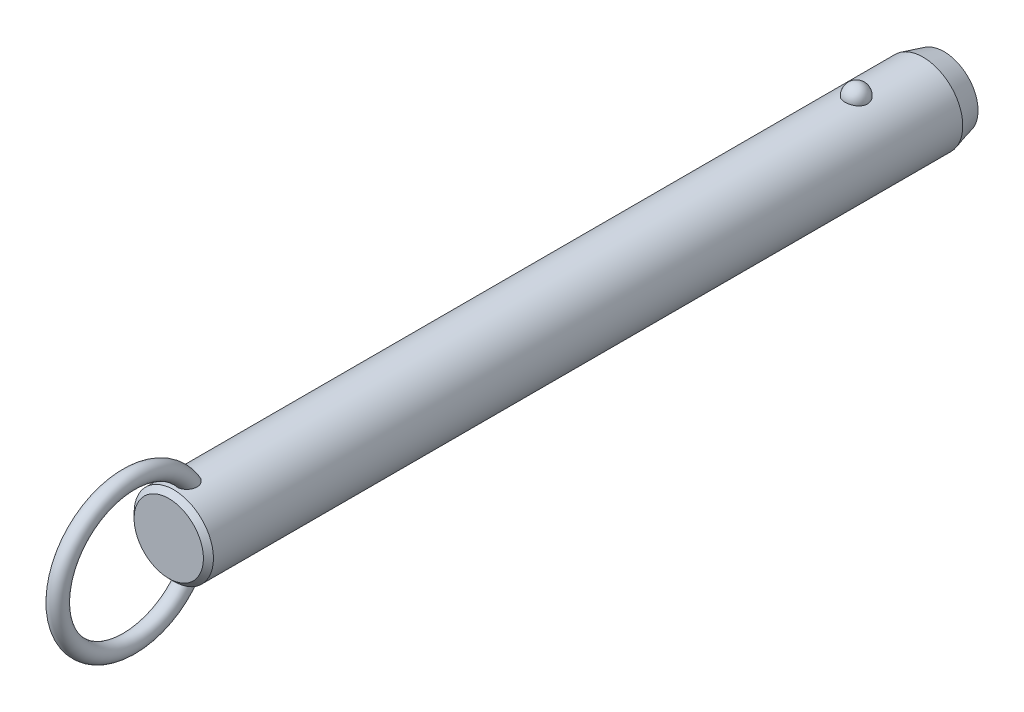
ISO-10303-21;
HEADER;
FILE_DESCRIPTION(('STEP AP214'),'2;1');
FILE_NAME('part.step','',(''),(''),'','','');
FILE_SCHEMA(('AUTOMOTIVE_DESIGN { 1 0 10303 214 1 1 1 1 }'));
ENDSEC;
DATA;
#1=APPLICATION_CONTEXT('core data for automotive mechanical design processes');
#2=APPLICATION_PROTOCOL_DEFINITION('international standard','automotive_design',2000,#1);
#3=PRODUCT_CONTEXT('',#1,'mechanical');
#4=PRODUCT('Part','Part','',(#3));
#5=PRODUCT_RELATED_PRODUCT_CATEGORY('part','',(#4));
#6=PRODUCT_DEFINITION_FORMATION('','',#4);
#7=PRODUCT_DEFINITION_CONTEXT('part definition',#1,'design');
#8=PRODUCT_DEFINITION('design','',#6,#7);
#9=PRODUCT_DEFINITION_SHAPE('','',#8);
#10=(LENGTH_UNIT() NAMED_UNIT(*) SI_UNIT(.MILLI.,.METRE.));
#11=(NAMED_UNIT(*) PLANE_ANGLE_UNIT() SI_UNIT($,.RADIAN.));
#12=(NAMED_UNIT(*) SI_UNIT($,.STERADIAN.) SOLID_ANGLE_UNIT());
#13=UNCERTAINTY_MEASURE_WITH_UNIT(LENGTH_MEASURE(1.E-05),#10,'distance_accuracy_value','');
#14=(GEOMETRIC_REPRESENTATION_CONTEXT(3) GLOBAL_UNCERTAINTY_ASSIGNED_CONTEXT((#13)) GLOBAL_UNIT_ASSIGNED_CONTEXT((#10,
#11,#12)) REPRESENTATION_CONTEXT('',''));
#15=CARTESIAN_POINT('',(0.,0.,0.));
#16=DIRECTION('',(0.,0.,1.));
#17=DIRECTION('',(1.,0.,0.));
#18=AXIS2_PLACEMENT_3D('',#15,#16,#17);
#19=CARTESIAN_POINT('',(0.,0.,152.4));
#20=DIRECTION('',(0.,0.,-1.));
#21=DIRECTION('',(-1.,0.,0.));
#22=AXIS2_PLACEMENT_3D('',#19,#20,#21);
#23=CYLINDRICAL_SURFACE('',#22,9.5);
#24=CARTESIAN_POINT('',(2.67259918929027,9.11631578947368,-2.7));
#25=CARTESIAN_POINT('',(2.6725968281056,9.11631786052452,-2.5490985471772));
#26=CARTESIAN_POINT('',(2.66030567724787,9.11994722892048,-2.39816735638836));
#27=CARTESIAN_POINT('',(2.6114347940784,9.13405924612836,-2.10058568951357));
#28=CARTESIAN_POINT('',(2.57484658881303,9.14454428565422,-1.9539367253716));
#29=CARTESIAN_POINT('',(2.47830875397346,9.17117631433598,-1.6691606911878));
#30=CARTESIAN_POINT('',(2.41836936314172,9.18732082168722,-1.53102991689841));
#31=CARTESIAN_POINT('',(2.27661331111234,9.22346780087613,-1.26705393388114));
#32=CARTESIAN_POINT('',(2.19479699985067,9.24347021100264,-1.14120852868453));
#33=CARTESIAN_POINT('',(2.01085282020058,9.28522401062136,-0.904632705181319));
#34=CARTESIAN_POINT('',(1.90862396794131,9.30698376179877,-0.793982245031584));
#35=CARTESIAN_POINT('',(1.6867437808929,9.34973971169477,-0.591607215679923));
#36=CARTESIAN_POINT('',(1.56709244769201,9.37073591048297,-0.4998826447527));
#37=CARTESIAN_POINT('',(1.31393976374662,9.40956370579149,-0.33816762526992));
#38=CARTESIAN_POINT('',(1.18048026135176,9.42740444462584,-0.268113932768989));
#39=CARTESIAN_POINT('',(0.903154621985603,9.45799906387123,-0.151390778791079));
#40=CARTESIAN_POINT('',(0.759289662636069,9.47075351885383,-0.104718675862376));
#41=CARTESIAN_POINT('',(0.468074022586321,9.48956256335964,-0.0367633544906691));
#42=CARTESIAN_POINT('',(0.320836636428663,9.49573643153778,-0.0150275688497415));
#43=CARTESIAN_POINT('',(0.0246714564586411,9.50112183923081,0.0039619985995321));
#44=CARTESIAN_POINT('',(-0.124256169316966,9.50033406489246,0.00121819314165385));
#45=CARTESIAN_POINT('',(-0.417264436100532,9.4919475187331,-0.0284441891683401));
#46=CARTESIAN_POINT('',(-0.56138413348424,9.48444885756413,-0.0550074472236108));
#47=CARTESIAN_POINT('',(-0.842986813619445,9.46357853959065,-0.131064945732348));
#48=CARTESIAN_POINT('',(-0.980469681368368,9.450206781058,-0.18055958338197));
#49=CARTESIAN_POINT('',(-1.24585005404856,9.41890822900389,-0.301476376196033));
#50=CARTESIAN_POINT('',(-1.37368611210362,9.40095498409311,-0.373026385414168));
#51=CARTESIAN_POINT('',(-1.61552738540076,9.36242964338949,-0.53602540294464));
#52=CARTESIAN_POINT('',(-1.72953116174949,9.34185727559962,-0.62747647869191));
#53=CARTESIAN_POINT('',(-1.9429225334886,9.29984568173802,-0.829844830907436));
#54=CARTESIAN_POINT('',(-2.04198021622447,9.27839736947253,-0.941108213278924));
#55=CARTESIAN_POINT('',(-2.2202646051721,9.23735994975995,-1.17883414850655));
#56=CARTESIAN_POINT('',(-2.29948985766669,9.21777097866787,-1.30529781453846));
#57=CARTESIAN_POINT('',(-2.43697287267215,9.18238994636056,-1.57158566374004));
#58=CARTESIAN_POINT('',(-2.49497068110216,9.16664569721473,-1.71155057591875));
#59=CARTESIAN_POINT('',(-2.5872073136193,9.14104303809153,-1.99961197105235));
#60=CARTESIAN_POINT('',(-2.62144683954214,9.13118445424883,-2.14770821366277));
#61=CARTESIAN_POINT('',(-2.66521466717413,9.11850622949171,-2.44715424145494));
#62=CARTESIAN_POINT('',(-2.67484831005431,9.11565658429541,-2.59848735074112));
#63=CARTESIAN_POINT('',(-2.66946735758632,9.11723375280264,-2.90067317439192));
#64=CARTESIAN_POINT('',(-2.65445345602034,9.12166036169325,-3.05152590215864));
#65=CARTESIAN_POINT('',(-2.60029711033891,9.13724422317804,-3.34766110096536));
#66=CARTESIAN_POINT('',(-2.56127978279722,9.14836656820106,-3.49296833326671));
#67=CARTESIAN_POINT('',(-2.46018844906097,9.17606676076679,-3.77477535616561));
#68=CARTESIAN_POINT('',(-2.39811349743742,9.1926448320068,-3.91127478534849));
#69=CARTESIAN_POINT('',(-2.25202303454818,9.22952198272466,-4.17244273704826));
#70=CARTESIAN_POINT('',(-2.16788714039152,9.24984129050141,-4.29704106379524));
#71=CARTESIAN_POINT('',(-1.97994083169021,9.29188255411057,-4.53013066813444));
#72=CARTESIAN_POINT('',(-1.87612963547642,9.31360456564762,-4.63862130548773));
#73=CARTESIAN_POINT('',(-1.65105429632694,9.35612959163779,-4.83690299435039));
#74=CARTESIAN_POINT('',(-1.52972405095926,9.37692871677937,-4.92661991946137));
#75=CARTESIAN_POINT('',(-1.27318250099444,9.41518970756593,-5.08429106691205));
#76=CARTESIAN_POINT('',(-1.13797219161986,9.432651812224,-5.15224684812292));
#77=CARTESIAN_POINT('',(-0.859280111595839,9.46208255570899,-5.26371827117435));
#78=CARTESIAN_POINT('',(-0.715925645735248,9.47411833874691,-5.30753421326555));
#79=CARTESIAN_POINT('',(-0.423550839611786,9.4916822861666,-5.37076321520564));
#80=CARTESIAN_POINT('',(-0.274531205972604,9.49721125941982,-5.39017930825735));
#81=CARTESIAN_POINT('',(0.0218446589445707,9.50110860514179,-5.40390587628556));
#82=CARTESIAN_POINT('',(0.169177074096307,9.49961381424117,-5.39869609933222));
#83=CARTESIAN_POINT('',(0.460808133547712,9.48993906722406,-5.3644195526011));
#84=CARTESIAN_POINT('',(0.605106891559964,9.48175936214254,-5.33535367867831));
#85=CARTESIAN_POINT('',(0.886027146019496,9.4596376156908,-5.2543558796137));
#86=CARTESIAN_POINT('',(1.02267710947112,9.44571881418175,-5.20251612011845));
#87=CARTESIAN_POINT('',(1.28523827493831,9.41358993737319,-5.07741549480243));
#88=CARTESIAN_POINT('',(1.41114877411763,9.39537958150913,-5.0041532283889));
#89=CARTESIAN_POINT('',(1.65085227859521,9.3562644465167,-4.83684599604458));
#90=CARTESIAN_POINT('',(1.76442346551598,9.33532178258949,-4.74249218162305));
#91=CARTESIAN_POINT('',(1.97425672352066,9.29321198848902,-4.53620389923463));
#92=CARTESIAN_POINT('',(2.07051582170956,9.27204482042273,-4.42426641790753));
#93=CARTESIAN_POINT('',(2.24490086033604,9.23139221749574,-4.18363183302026));
#94=CARTESIAN_POINT('',(2.32267019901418,9.21194380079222,-4.05466990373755));
#95=CARTESIAN_POINT('',(2.45584092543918,9.1773419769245,-3.78517836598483));
#96=CARTESIAN_POINT('',(2.5112497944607,9.16218713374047,-3.64465264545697));
#97=CARTESIAN_POINT('',(2.59380876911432,9.13913522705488,-3.37104301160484));
#98=CARTESIAN_POINT('',(2.62330266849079,9.13064624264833,-3.23871053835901));
#99=CARTESIAN_POINT('',(2.66269870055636,9.11923566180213,-2.97092664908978));
#100=CARTESIAN_POINT('',(2.67260130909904,9.11631393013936,-2.8354753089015));
#101=CARTESIAN_POINT('',(2.67259918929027,9.11631578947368,-2.7));
#102=B_SPLINE_CURVE_WITH_KNOTS('',3,(#24,#25,#26,#27,#28,#29,#30,#31,#32,#33,#34,#35,#36,#37,
#38,#39,#40,#41,#42,#43,#44,#45,#46,#47,#48,#49,#50,#51,#52,#53,#54,#55,#56,#57,#58,#59,#60,#61,
#62,#63,#64,#65,#66,#67,#68,#69,#70,#71,#72,#73,#74,#75,#76,#77,#78,#79,#80,#81,#82,#83,#84,#85,
#86,#87,#88,#89,#90,#91,#92,#93,#94,#95,#96,#97,#98,#99,#100,#101),.UNSPECIFIED.,.T.,.F.,(4,2,2,
2,2,2,2,2,2,2,2,2,2,2,2,2,2,2,2,2,2,2,2,2,2,2,2,2,2,2,2,2,2,2,2,2,2,2,4),(0.,0.452217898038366,
0.904593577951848,1.35677112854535,1.80894144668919,2.26340676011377,2.71787203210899,
3.17099820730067,3.62407318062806,4.06878835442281,4.51345969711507,4.95160616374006,
5.38976021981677,5.83050358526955,6.27129275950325,6.72071308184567,7.17016633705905,
7.62495278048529,8.07972578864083,8.53254856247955,8.98535859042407,9.43582813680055,
9.88631615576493,10.3393155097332,10.7923328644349,11.2471065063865,11.7018475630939,
12.150795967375,12.599688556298,13.0398725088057,13.4800399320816,13.9184421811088,
14.3568730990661,14.802202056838,15.2476074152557,15.7010097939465,16.1542603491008,
16.5602594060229,16.9662486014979),.UNSPECIFIED.);
#103=CARTESIAN_POINT('',(2.67259918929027,9.11631578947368,-2.7));
#104=VERTEX_POINT('',#103);
#105=EDGE_CURVE('E41',#104,#104,#102,.T.);
#106=ORIENTED_EDGE('',*,*,#105,.T.);
#107=EDGE_LOOP('',(#106));
#108=FACE_BOUND('',#107,.T.);
#109=CARTESIAN_POINT('',(0.,0.,160.72));
#110=DIRECTION('',(0.,0.,1.));
#111=DIRECTION('',(1.,0.,0.));
#112=AXIS2_PLACEMENT_3D('',#109,#110,#111);
#113=CIRCLE('',#112,9.5);
#114=CARTESIAN_POINT('',(9.5,0.,160.72));
#115=VERTEX_POINT('',#114);
#116=EDGE_CURVE('E10',#115,#115,#113,.F.);
#117=ORIENTED_EDGE('',*,*,#116,.T.);
#118=EDGE_LOOP('',(#117));
#119=FACE_BOUND('',#118,.T.);
#120=CARTESIAN_POINT('',(-0.697062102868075,-9.47439269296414,155.067808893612));
#121=CARTESIAN_POINT('',(-0.799579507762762,-9.46685146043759,155.107482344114));
#122=CARTESIAN_POINT('',(-0.898575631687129,-9.45788043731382,155.1559309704));
#123=CARTESIAN_POINT('',(-1.08670047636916,-9.43811593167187,155.268868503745));
#124=CARTESIAN_POINT('',(-1.17583204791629,-9.42732297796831,155.333352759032));
#125=CARTESIAN_POINT('',(-1.34179806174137,-9.40513672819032,155.476209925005));
#126=CARTESIAN_POINT('',(-1.41865133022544,-9.39374438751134,155.554561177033));
#127=CARTESIAN_POINT('',(-1.55860047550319,-9.37154196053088,155.722752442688));
#128=CARTESIAN_POINT('',(-1.62169476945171,-9.3607319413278,155.81259377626));
#129=CARTESIAN_POINT('',(-1.73527695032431,-9.34035749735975,156.004500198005));
#130=CARTESIAN_POINT('',(-1.78522266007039,-9.33085270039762,156.106891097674));
#131=CARTESIAN_POINT('',(-1.86924997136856,-9.3143834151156,156.318148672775));
#132=CARTESIAN_POINT('',(-1.90332570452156,-9.30741986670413,156.427017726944));
#133=CARTESIAN_POINT('',(-1.95893603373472,-9.29588482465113,156.660473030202));
#134=CARTESIAN_POINT('',(-1.97872420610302,-9.29165182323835,156.785489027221));
#135=CARTESIAN_POINT('',(-2.00062129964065,-9.28695978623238,157.037080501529));
#136=CARTESIAN_POINT('',(-2.00272284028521,-9.28650232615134,157.163656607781));
#137=CARTESIAN_POINT('',(-1.98958876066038,-9.28932750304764,157.436815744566));
#138=CARTESIAN_POINT('',(-1.97143366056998,-9.2932400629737,157.583251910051));
#139=CARTESIAN_POINT('',(-1.91479925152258,-9.30507151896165,157.872062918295));
#140=CARTESIAN_POINT('',(-1.87629122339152,-9.31299607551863,158.014431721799));
#141=CARTESIAN_POINT('',(-1.7722568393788,-9.33340232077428,158.315172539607));
#142=CARTESIAN_POINT('',(-1.70334898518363,-9.34641636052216,158.472369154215));
#143=CARTESIAN_POINT('',(-1.58111062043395,-9.36759153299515,158.697517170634));
#144=CARTESIAN_POINT('',(-1.53721459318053,-9.3749261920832,158.770796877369));
#145=CARTESIAN_POINT('',(-1.44302631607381,-9.38988566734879,158.91307405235));
#146=CARTESIAN_POINT('',(-1.39273721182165,-9.39751033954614,158.982073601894));
#147=CARTESIAN_POINT('',(-1.26775962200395,-9.41530678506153,159.136983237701));
#148=CARTESIAN_POINT('',(-1.19052326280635,-9.42548108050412,159.220871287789));
#149=CARTESIAN_POINT('',(-1.02420241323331,-9.44499825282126,159.376008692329));
#150=CARTESIAN_POINT('',(-0.935139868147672,-9.45434261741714,159.447280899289));
#151=CARTESIAN_POINT('',(-0.766610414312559,-9.46930670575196,159.558695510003));
#152=CARTESIAN_POINT('',(-0.689439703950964,-9.47529223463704,159.602235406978));
#153=CARTESIAN_POINT('',(-0.52894200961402,-9.48560294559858,159.67631336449));
#154=CARTESIAN_POINT('',(-0.445620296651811,-9.48992953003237,159.706862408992));
#155=CARTESIAN_POINT('',(-0.273901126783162,-9.49644161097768,159.752579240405));
#156=CARTESIAN_POINT('',(-0.18546574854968,-9.49860811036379,159.76761059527));
#157=CARTESIAN_POINT('',(-0.00734541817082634,-9.5004135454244,159.780149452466));
#158=CARTESIAN_POINT('',(0.0823387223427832,-9.50005405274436,159.777667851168));
#159=CARTESIAN_POINT('',(0.247679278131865,-9.49708301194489,159.756995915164));
#160=CARTESIAN_POINT('',(0.323620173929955,-9.49477609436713,159.740930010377));
#161=CARTESIAN_POINT('',(0.471981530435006,-9.48855917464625,159.697172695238));
#162=CARTESIAN_POINT('',(0.544400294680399,-9.48464840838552,159.669475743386));
#163=CARTESIAN_POINT('',(0.708947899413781,-9.47398336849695,159.59280266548));
#164=CARTESIAN_POINT('',(0.799149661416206,-9.46671310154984,159.539774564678));
#165=CARTESIAN_POINT('',(0.969783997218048,-9.45076225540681,159.419973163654));
#166=CARTESIAN_POINT('',(1.05019415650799,-9.44207854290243,159.353169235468));
#167=CARTESIAN_POINT('',(1.23092343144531,-9.42051459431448,159.180759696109));
#168=CARTESIAN_POINT('',(1.32652499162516,-9.40733378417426,159.07026193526));
#169=CARTESIAN_POINT('',(1.49893121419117,-9.38140745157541,158.835561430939));
#170=CARTESIAN_POINT('',(1.57571616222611,-9.36866239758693,158.711344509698));
#171=CARTESIAN_POINT('',(1.71285426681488,-9.34457644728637,158.449389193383));
#172=CARTESIAN_POINT('',(1.77266365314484,-9.33328726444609,158.31136233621));
#173=CARTESIAN_POINT('',(1.87239208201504,-9.31379209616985,158.028051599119));
#174=CARTESIAN_POINT('',(1.91230158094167,-9.30558759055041,157.882764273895));
#175=CARTESIAN_POINT('',(1.97604189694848,-9.29228394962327,157.562028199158));
#176=CARTESIAN_POINT('',(1.9958743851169,-9.28797202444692,157.385724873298));
#177=CARTESIAN_POINT('',(2.00295708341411,-9.28645519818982,157.032414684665));
#178=CARTESIAN_POINT('',(1.99025930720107,-9.28923895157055,156.855409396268));
#179=CARTESIAN_POINT('',(1.93735479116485,-9.30038134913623,156.556338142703));
#180=CARTESIAN_POINT('',(1.90576827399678,-9.30697680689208,156.432667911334));
#181=CARTESIAN_POINT('',(1.82287484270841,-9.32356855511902,156.192329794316));
#182=CARTESIAN_POINT('',(1.77158213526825,-9.33356239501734,156.075656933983));
#183=CARTESIAN_POINT('',(1.64885744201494,-9.35602275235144,155.852706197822));
#184=CARTESIAN_POINT('',(1.57730995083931,-9.36850332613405,155.746492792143));
#185=CARTESIAN_POINT('',(1.41543264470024,-9.39431873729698,155.549553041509));
#186=CARTESIAN_POINT('',(1.32510883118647,-9.40765330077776,155.458821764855));
#187=CARTESIAN_POINT('',(1.13846223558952,-9.43195720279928,155.305033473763));
#188=CARTESIAN_POINT('',(1.04369890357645,-9.44302894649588,155.240094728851));
#189=CARTESIAN_POINT('',(0.843965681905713,-9.46296805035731,155.128038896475));
#190=CARTESIAN_POINT('',(0.739000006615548,-9.47183631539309,155.080914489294));
#191=CARTESIAN_POINT('',(0.528175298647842,-9.48586140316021,155.008117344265));
#192=CARTESIAN_POINT('',(0.422686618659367,-9.49119633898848,154.98140249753));
#193=CARTESIAN_POINT('',(0.208590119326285,-9.49831365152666,154.946013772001));
#194=CARTESIAN_POINT('',(0.0999817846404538,-9.500095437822,154.937342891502));
#195=CARTESIAN_POINT('',(-0.126104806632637,-9.49988861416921,154.938350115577));
#196=CARTESIAN_POINT('',(-0.24357872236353,-9.49757821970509,154.949594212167));
#197=CARTESIAN_POINT('',(-0.474390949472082,-9.48885165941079,154.993167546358));
#198=CARTESIAN_POINT('',(-0.587729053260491,-9.48243528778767,155.025497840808));
#199=CARTESIAN_POINT('',(-0.697062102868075,-9.47439269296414,155.067808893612));
#200=B_SPLINE_CURVE_WITH_KNOTS('',3,(#120,#121,#122,#123,#124,#125,#126,#127,#128,#129,#130,
#131,#132,#133,#134,#135,#136,#137,#138,#139,#140,#141,#142,#143,#144,#145,#146,#147,#148,#149,
#150,#151,#152,#153,#154,#155,#156,#157,#158,#159,#160,#161,#162,#163,#164,#165,#166,#167,#168,
#169,#170,#171,#172,#173,#174,#175,#176,#177,#178,#179,#180,#181,#182,#183,#184,#185,#186,#187,
#188,#189,#190,#191,#192,#193,#194,#195,#196,#197,#198,#199),.UNSPECIFIED.,.T.,.F.,(4,2,2,2,2,2,
2,2,2,2,2,2,2,2,2,2,2,2,2,2,2,2,2,2,2,2,2,2,2,2,2,2,2,2,2,2,2,2,2,4),(0.,0.330119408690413,
0.6601431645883,0.98965593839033,1.31920659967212,1.660747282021,2.00241415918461,
2.38088696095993,2.75951768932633,3.20065679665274,3.64242004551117,4.15620996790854,
4.41314162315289,4.66994734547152,5.0122866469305,5.35399933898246,5.61943037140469,
5.88463652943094,6.15215502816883,6.41950709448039,6.65144391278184,6.88349136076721,
7.19641200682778,7.51003602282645,7.94779711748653,8.3860149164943,8.83699707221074,
9.28819530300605,9.81778662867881,10.34653170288,10.7284172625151,11.1100280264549,
11.4938603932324,11.8775702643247,12.2220189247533,12.5663259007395,12.8915939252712,
13.2169159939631,13.5689650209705,13.9210316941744),.UNSPECIFIED.);
#201=CARTESIAN_POINT('',(-0.697062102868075,-9.47439269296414,155.067808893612));
#202=VERTEX_POINT('',#201);
#203=EDGE_CURVE('E60',#202,#202,#200,.T.);
#204=ORIENTED_EDGE('',*,*,#203,.T.);
#205=EDGE_LOOP('',(#204));
#206=FACE_BOUND('',#205,.T.);
#207=CARTESIAN_POINT('',(-0.697062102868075,9.47439269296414,155.067808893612));
#208=CARTESIAN_POINT('',(-0.597792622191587,9.48169483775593,155.02939564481));
#209=CARTESIAN_POINT('',(-0.495106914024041,9.48766580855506,154.999168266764));
#210=CARTESIAN_POINT('',(-0.285876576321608,9.49627648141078,154.956032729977));
#211=CARTESIAN_POINT('',(-0.179324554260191,9.49890941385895,154.943159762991));
#212=CARTESIAN_POINT('',(0.0344157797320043,9.50053798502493,154.935166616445));
#213=CARTESIAN_POINT('',(0.14160360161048,9.49953613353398,154.940034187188));
#214=CARTESIAN_POINT('',(0.353563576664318,9.49401038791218,154.967365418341));
#215=CARTESIAN_POINT('',(0.458336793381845,9.48948807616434,154.98982117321));
#216=CARTESIAN_POINT('',(0.662493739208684,9.4774236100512,155.051671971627));
#217=CARTESIAN_POINT('',(0.761881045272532,9.46988348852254,155.091055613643));
#218=CARTESIAN_POINT('',(0.952608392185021,9.45260382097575,155.185634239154));
#219=CARTESIAN_POINT('',(1.04394806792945,9.44286417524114,155.240829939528));
#220=CARTESIAN_POINT('',(1.21712767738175,9.42211760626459,155.366066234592));
#221=CARTESIAN_POINT('',(1.29885671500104,9.41109835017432,155.436257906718));
#222=CARTESIAN_POINT('',(1.44978975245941,9.38903310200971,155.588980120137));
#223=CARTESIAN_POINT('',(1.51899278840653,9.37798710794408,155.671511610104));
#224=CARTESIAN_POINT('',(1.64602857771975,9.35654375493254,155.849776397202));
#225=CARTESIAN_POINT('',(1.70333052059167,9.34618688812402,155.945891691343));
#226=CARTESIAN_POINT('',(1.80259341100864,9.32755128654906,156.145897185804));
#227=CARTESIAN_POINT('',(1.84454942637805,9.31927322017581,156.249789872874));
#228=CARTESIAN_POINT('',(1.91637039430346,9.30478365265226,156.472213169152));
#229=CARTESIAN_POINT('',(1.944805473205,9.29882552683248,156.591219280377));
#230=CARTESIAN_POINT('',(1.98449865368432,9.29043398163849,156.832143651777));
#231=CARTESIAN_POINT('',(1.99574908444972,9.28800213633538,156.954063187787));
#232=CARTESIAN_POINT('',(2.00275141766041,9.28649645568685,157.216932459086));
#233=CARTESIAN_POINT('',(1.99588238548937,9.28799035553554,157.357952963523));
#234=CARTESIAN_POINT('',(1.96270559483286,9.29505517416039,157.637621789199));
#235=CARTESIAN_POINT('',(1.93637872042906,9.30063010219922,157.776267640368));
#236=CARTESIAN_POINT('',(1.85949176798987,9.31633564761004,158.072561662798));
#237=CARTESIAN_POINT('',(1.80549792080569,9.3270926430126,158.229290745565));
#238=CARTESIAN_POINT('',(1.67376869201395,9.35163064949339,158.532284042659));
#239=CARTESIAN_POINT('',(1.59603181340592,9.36541185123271,158.678547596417));
#240=CARTESIAN_POINT('',(1.4360277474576,9.39110706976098,158.925813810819));
#241=CARTESIAN_POINT('',(1.35831795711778,9.40278656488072,159.029791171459));
#242=CARTESIAN_POINT('',(1.18774483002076,9.42585025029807,159.224534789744));
#243=CARTESIAN_POINT('',(1.09490932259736,9.43723493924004,159.315324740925));
#244=CARTESIAN_POINT('',(0.921110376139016,9.45552616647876,159.45620334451));
#245=CARTESIAN_POINT('',(0.843738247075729,9.46281058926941,159.510656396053));
#246=CARTESIAN_POINT('',(0.681245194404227,9.47589120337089,159.606711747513));
#247=CARTESIAN_POINT('',(0.596135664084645,9.48168953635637,159.648332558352));
#248=CARTESIAN_POINT('',(0.433779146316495,9.49038144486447,159.710089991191));
#249=CARTESIAN_POINT('',(0.357459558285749,9.49359170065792,159.73260136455));
#250=CARTESIAN_POINT('',(0.202074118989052,9.49816761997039,159.764574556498));
#251=CARTESIAN_POINT('',(0.123010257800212,9.49953459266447,159.774045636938));
#252=CARTESIAN_POINT('',(-0.035737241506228,9.50026497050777,159.779114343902));
#253=CARTESIAN_POINT('',(-0.115421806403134,9.49962433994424,159.774684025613));
#254=CARTESIAN_POINT('',(-0.272823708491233,9.49640854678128,159.752296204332));
#255=CARTESIAN_POINT('',(-0.350540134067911,9.4938325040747,159.734332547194));
#256=CARTESIAN_POINT('',(-0.500580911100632,9.48709462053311,159.686802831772));
#257=CARTESIAN_POINT('',(-0.572979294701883,9.48296359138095,159.657461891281));
#258=CARTESIAN_POINT('',(-0.712864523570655,9.47347609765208,159.589008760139));
#259=CARTESIAN_POINT('',(-0.780349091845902,9.46811906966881,159.549892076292));
#260=CARTESIAN_POINT('',(-0.946309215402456,9.45329720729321,159.439432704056));
#261=CARTESIAN_POINT('',(-1.04090230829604,9.44321512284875,159.362329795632));
#262=CARTESIAN_POINT('',(-1.21661929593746,9.42219227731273,159.19409718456));
#263=CARTESIAN_POINT('',(-1.29770519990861,9.41124921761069,159.102929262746));
#264=CARTESIAN_POINT('',(-1.47319646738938,9.38563439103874,158.876162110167));
#265=CARTESIAN_POINT('',(-1.5620887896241,9.37102009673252,158.736289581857));
#266=CARTESIAN_POINT('',(-1.71623987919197,9.34401559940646,158.443950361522));
#267=CARTESIAN_POINT('',(-1.7814786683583,9.33162728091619,158.291473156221));
#268=CARTESIAN_POINT('',(-1.88853837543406,9.31055541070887,157.975647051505));
#269=CARTESIAN_POINT('',(-1.92998995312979,9.30193076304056,157.812168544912));
#270=CARTESIAN_POINT('',(-1.98590726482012,9.29015757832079,157.480526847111));
#271=CARTESIAN_POINT('',(-2.0004070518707,9.2870021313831,157.312369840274));
#272=CARTESIAN_POINT('',(-1.99964701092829,9.28716218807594,157.005080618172));
#273=CARTESIAN_POINT('',(-1.98908145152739,9.28945704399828,156.865936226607));
#274=CARTESIAN_POINT('',(-1.94566294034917,9.29865169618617,156.591153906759));
#275=CARTESIAN_POINT('',(-1.91282062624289,9.30554929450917,156.455514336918));
#276=CARTESIAN_POINT('',(-1.84582133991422,9.31898248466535,156.257802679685));
#277=CARTESIAN_POINT('',(-1.82038084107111,9.32400364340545,156.192583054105));
#278=CARTESIAN_POINT('',(-1.7635051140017,9.33492884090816,156.064903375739));
#279=CARTESIAN_POINT('',(-1.73207305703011,9.34083241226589,156.002441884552));
#280=CARTESIAN_POINT('',(-1.66324243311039,9.35333332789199,155.88094078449));
#281=CARTESIAN_POINT('',(-1.625842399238,9.35993084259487,155.821902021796));
#282=CARTESIAN_POINT('',(-1.54527678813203,9.37356864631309,155.707987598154));
#283=CARTESIAN_POINT('',(-1.50211241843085,9.38060884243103,155.653111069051));
#284=CARTESIAN_POINT('',(-1.37681147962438,9.40004442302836,155.509961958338));
#285=CARTESIAN_POINT('',(-1.28916358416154,9.41261047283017,155.426429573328));
#286=CARTESIAN_POINT('',(-1.09996826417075,9.43658180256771,155.277236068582));
#287=CARTESIAN_POINT('',(-0.998461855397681,9.44799034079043,155.211523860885));
#288=CARTESIAN_POINT('',(-0.860188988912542,9.46103017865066,155.1394367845));
#289=CARTESIAN_POINT('',(-0.828141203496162,9.46389141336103,155.123851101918));
#290=CARTESIAN_POINT('',(-0.763210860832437,9.46934915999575,155.094473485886));
#291=CARTESIAN_POINT('',(-0.730328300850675,9.47194567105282,155.080681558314));
#292=CARTESIAN_POINT('',(-0.697062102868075,9.47439269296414,155.067808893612));
#293=B_SPLINE_CURVE_WITH_KNOTS('',3,(#207,#208,#209,#210,#211,#212,#213,#214,#215,#216,#217,
#218,#219,#220,#221,#222,#223,#224,#225,#226,#227,#228,#229,#230,#231,#232,#233,#234,#235,#236,
#237,#238,#239,#240,#241,#242,#243,#244,#245,#246,#247,#248,#249,#250,#251,#252,#253,#254,#255,
#256,#257,#258,#259,#260,#261,#262,#263,#264,#265,#266,#267,#268,#269,#270,#271,#272,#273,#274,
#275,#276,#277,#278,#279,#280,#281,#282,#283,#284,#285,#286,#287,#288,#289,#290,#291,#292),
.UNSPECIFIED.,.T.,.F.,(4,2,2,2,2,2,2,2,2,2,2,2,2,2,2,2,2,2,2,2,2,2,2,2,2,2,2,2,2,2,2,2,2,2,2,2,
2,2,2,2,2,2,4),(0.,0.319942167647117,0.640532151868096,0.960900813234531,1.28112555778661,
1.60113495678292,1.92115886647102,2.24457323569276,2.56801248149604,2.90371927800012,
3.23953387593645,3.60560313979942,3.97183576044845,4.39383693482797,4.81625324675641,
5.31257045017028,5.80891895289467,6.19868344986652,6.58773876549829,6.87145417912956,
7.15475838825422,7.3926375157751,7.63034760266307,7.86853584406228,8.10683246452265,
8.34063661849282,8.57454843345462,8.93983939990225,9.30614105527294,9.80266668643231,
10.2996107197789,10.8040753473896,11.3079021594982,11.7249776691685,12.1418541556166,
12.3521485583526,12.5623319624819,12.7725671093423,12.9827582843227,13.345827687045,
13.7078449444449,13.8150604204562,13.9222762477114),.UNSPECIFIED.);
#294=CARTESIAN_POINT('',(-0.697062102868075,9.47439269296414,155.067808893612));
#295=VERTEX_POINT('',#294);
#296=EDGE_CURVE('E67',#295,#295,#293,.T.);
#297=ORIENTED_EDGE('',*,*,#296,.T.);
#298=EDGE_LOOP('',(#297));
#299=FACE_BOUND('',#298,.T.);
#300=CARTESIAN_POINT('',(0.,0.,-18.7000000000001));
#301=DIRECTION('',(0.,0.,-1.));
#302=DIRECTION('',(-1.,0.,0.));
#303=AXIS2_PLACEMENT_3D('',#300,#301,#302);
#304=CIRCLE('',#303,9.5);
#305=CARTESIAN_POINT('',(-9.5,0.,-18.7000000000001));
#306=VERTEX_POINT('',#305);
#307=EDGE_CURVE('E57',#306,#306,#304,.F.);
#308=ORIENTED_EDGE('',*,*,#307,.T.);
#309=EDGE_LOOP('',(#308));
#310=FACE_BOUND('',#309,.T.);
#311=ADVANCED_FACE('F37',(#108,#119,#206,#299,#310),#23,.T.);
#312=CARTESIAN_POINT('',(0.,0.,-23.7));
#313=DIRECTION('',(0.,0.,-1.));
#314=DIRECTION('',(-1.,0.,0.));
#315=AXIS2_PLACEMENT_3D('',#312,#313,#314);
#316=PLANE('',#315);
#317=CARTESIAN_POINT('',(0.,0.,-23.7));
#318=DIRECTION('',(0.,0.,-1.));
#319=DIRECTION('',(-1.,0.,0.));
#320=AXIS2_PLACEMENT_3D('',#317,#318,#319);
#321=CIRCLE('',#320,8.1602540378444);
#322=CARTESIAN_POINT('',(-8.1602540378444,0.,-23.7));
#323=VERTEX_POINT('',#322);
#324=EDGE_CURVE('E66',#323,#323,#321,.T.);
#325=ORIENTED_EDGE('',*,*,#324,.T.);
#326=EDGE_LOOP('',(#325));
#327=FACE_BOUND('',#326,.T.);
#328=ADVANCED_FACE('F85',(#327),#316,.T.);
#329=CARTESIAN_POINT('',(0.,0.,-23.7));
#330=DIRECTION('',(0.,0.,1.));
#331=DIRECTION('',(1.,0.,0.));
#332=AXIS2_PLACEMENT_3D('',#329,#330,#331);
#333=CONICAL_SURFACE('',#332,8.1602540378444,0.261799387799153);
#334=ORIENTED_EDGE('',*,*,#307,.F.);
#335=EDGE_LOOP('',(#334));
#336=FACE_BOUND('',#335,.T.);
#337=ORIENTED_EDGE('',*,*,#324,.F.);
#338=EDGE_LOOP('',(#337));
#339=FACE_BOUND('',#338,.T.);
#340=ADVANCED_FACE('F83',(#336,#339),#333,.T.);
#341=CARTESIAN_POINT('',(0.,0.,161.92));
#342=DIRECTION('',(0.,0.,1.));
#343=DIRECTION('',(1.,0.,0.));
#344=AXIS2_PLACEMENT_3D('',#341,#342,#343);
#345=PLANE('',#344);
#346=CARTESIAN_POINT('',(0.,0.,161.92));
#347=DIRECTION('',(0.,0.,1.));
#348=DIRECTION('',(1.,0.,0.));
#349=AXIS2_PLACEMENT_3D('',#346,#347,#348);
#350=CIRCLE('',#349,8.30000000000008);
#351=CARTESIAN_POINT('',(8.30000000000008,0.,161.92));
#352=VERTEX_POINT('',#351);
#353=EDGE_CURVE('E50',#352,#352,#350,.T.);
#354=ORIENTED_EDGE('',*,*,#353,.T.);
#355=EDGE_LOOP('',(#354));
#356=FACE_BOUND('',#355,.T.);
#357=ADVANCED_FACE('F77',(#356),#345,.T.);
#358=CARTESIAN_POINT('',(0.,0.,171.45));
#359=DIRECTION('',(1.,0.,0.));
#360=DIRECTION('',(0.,0.,-1.));
#361=AXIS2_PLACEMENT_3D('',#358,#359,#360);
#362=TOROIDAL_SURFACE('',#361,17.05,2.);
#363=ORIENTED_EDGE('',*,*,#296,.F.);
#364=EDGE_LOOP('',(#363));
#365=FACE_BOUND('',#364,.T.);
#366=ORIENTED_EDGE('',*,*,#203,.F.);
#367=EDGE_LOOP('',(#366));
#368=FACE_BOUND('',#367,.T.);
#369=ADVANCED_FACE('F73',(#365,#368),#362,.T.);
#370=CARTESIAN_POINT('',(0.,0.,161.92));
#371=DIRECTION('',(0.,0.,-1.));
#372=DIRECTION('',(-1.,0.,0.));
#373=AXIS2_PLACEMENT_3D('',#370,#371,#372);
#374=CONICAL_SURFACE('',#373,8.30000000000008,0.785398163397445);
#375=ORIENTED_EDGE('',*,*,#116,.F.);
#376=EDGE_LOOP('',(#375));
#377=FACE_BOUND('',#376,.T.);
#378=ORIENTED_EDGE('',*,*,#353,.F.);
#379=EDGE_LOOP('',(#378));
#380=FACE_BOUND('',#379,.T.);
#381=ADVANCED_FACE('F39',(#377,#380),#374,.T.);
#382=CARTESIAN_POINT('',(0.,9.5,-2.69999999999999));
#383=DIRECTION('',(0.,1.,0.));
#384=DIRECTION('',(0.,0.,-1.));
#385=AXIS2_PLACEMENT_3D('',#382,#383,#384);
#386=SPHERICAL_SURFACE('',#385,2.7);
#387=ORIENTED_EDGE('',*,*,#105,.F.);
#388=EDGE_LOOP('',(#387));
#389=FACE_BOUND('',#388,.T.);
#390=ADVANCED_FACE('F79',(#389),#386,.T.);
#391=CLOSED_SHELL('',(#311,#328,#340,#357,#369,#381,#390));
#392=MANIFOLD_SOLID_BREP('B2',#391);
#393=ADVANCED_BREP_SHAPE_REPRESENTATION('',(#18,#392),#14);
#394=SHAPE_DEFINITION_REPRESENTATION(#9,#393);
ENDSEC;
END-ISO-10303-21;
